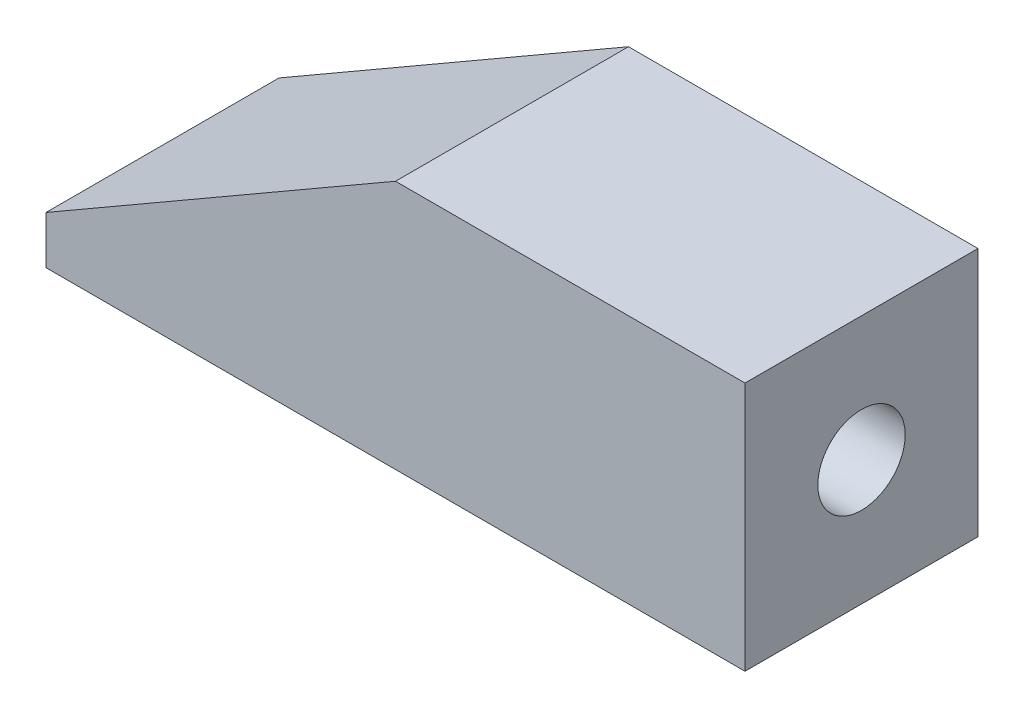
ISO-10303-21;
HEADER;
FILE_DESCRIPTION(('STEP AP214'),'2;1');
FILE_NAME('part.step','',(''),(''),'','','');
FILE_SCHEMA(('AUTOMOTIVE_DESIGN { 1 0 10303 214 1 1 1 1 }'));
ENDSEC;
DATA;
#1=APPLICATION_CONTEXT('core data for automotive mechanical design processes');
#2=APPLICATION_PROTOCOL_DEFINITION('international standard','automotive_design',2000,#1);
#3=PRODUCT_CONTEXT('',#1,'mechanical');
#4=PRODUCT('Part','Part','',(#3));
#5=PRODUCT_RELATED_PRODUCT_CATEGORY('part','',(#4));
#6=PRODUCT_DEFINITION_FORMATION('','',#4);
#7=PRODUCT_DEFINITION_CONTEXT('part definition',#1,'design');
#8=PRODUCT_DEFINITION('design','',#6,#7);
#9=PRODUCT_DEFINITION_SHAPE('','',#8);
#10=(LENGTH_UNIT() NAMED_UNIT(*) SI_UNIT(.MILLI.,.METRE.));
#11=(NAMED_UNIT(*) PLANE_ANGLE_UNIT() SI_UNIT($,.RADIAN.));
#12=(NAMED_UNIT(*) SI_UNIT($,.STERADIAN.) SOLID_ANGLE_UNIT());
#13=UNCERTAINTY_MEASURE_WITH_UNIT(LENGTH_MEASURE(1.E-05),#10,'distance_accuracy_value','');
#14=(GEOMETRIC_REPRESENTATION_CONTEXT(3) GLOBAL_UNCERTAINTY_ASSIGNED_CONTEXT((#13)) GLOBAL_UNIT_ASSIGNED_CONTEXT((#10,
#11,#12)) REPRESENTATION_CONTEXT('',''));
#15=CARTESIAN_POINT('',(0.,0.,0.));
#16=DIRECTION('',(0.,0.,1.));
#17=DIRECTION('',(1.,0.,0.));
#18=AXIS2_PLACEMENT_3D('',#15,#16,#17);
#19=CARTESIAN_POINT('',(0.,0.,28.));
#20=DIRECTION('',(1.,0.,0.));
#21=DIRECTION('',(0.,1.,0.));
#22=AXIS2_PLACEMENT_3D('',#19,#20,#21);
#23=PLANE('',#22);
#24=DIRECTION('',(0.,-1.,0.));
#25=VECTOR('',#24,1.);
#26=CARTESIAN_POINT('',(0.,0.,0.));
#27=LINE('',#26,#25);
#28=CARTESIAN_POINT('',(0.,5.75128869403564,0.));
#29=VERTEX_POINT('',#28);
#30=CARTESIAN_POINT('',(0.,0.,0.));
#31=VERTEX_POINT('',#30);
#32=EDGE_CURVE('E95',#29,#31,#27,.T.);
#33=ORIENTED_EDGE('',*,*,#32,.T.);
#34=DIRECTION('',(0.,0.,-1.));
#35=VECTOR('',#34,1.);
#36=CARTESIAN_POINT('',(0.,0.,28.));
#37=LINE('',#36,#35);
#38=CARTESIAN_POINT('',(0.,0.,28.));
#39=VERTEX_POINT('',#38);
#40=EDGE_CURVE('E11',#39,#31,#37,.T.);
#41=ORIENTED_EDGE('',*,*,#40,.F.);
#42=DIRECTION('',(0.,-1.,0.));
#43=VECTOR('',#42,1.);
#44=CARTESIAN_POINT('',(0.,0.,28.));
#45=LINE('',#44,#43);
#46=CARTESIAN_POINT('',(0.,5.75128869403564,28.));
#47=VERTEX_POINT('',#46);
#48=EDGE_CURVE('E108',#47,#39,#45,.T.);
#49=ORIENTED_EDGE('',*,*,#48,.F.);
#50=DIRECTION('',(0.,0.,-1.));
#51=VECTOR('',#50,1.);
#52=CARTESIAN_POINT('',(0.,5.75128869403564,28.));
#53=LINE('',#52,#51);
#54=EDGE_CURVE('E116',#47,#29,#53,.T.);
#55=ORIENTED_EDGE('',*,*,#54,.T.);
#56=EDGE_LOOP('',(#33,#41,#49,#55));
#57=FACE_BOUND('',#56,.T.);
#58=ADVANCED_FACE('F36',(#57),#23,.F.);
#59=CARTESIAN_POINT('',(0.,0.,28.));
#60=DIRECTION('',(0.,1.,0.));
#61=DIRECTION('',(0.,0.,1.));
#62=AXIS2_PLACEMENT_3D('',#59,#60,#61);
#63=PLANE('',#62);
#64=DIRECTION('',(1.,0.,0.));
#65=VECTOR('',#64,1.);
#66=CARTESIAN_POINT('',(0.,0.,0.));
#67=LINE('',#66,#65);
#68=CARTESIAN_POINT('',(84.,0.,0.));
#69=VERTEX_POINT('',#68);
#70=EDGE_CURVE('E100',#31,#69,#67,.T.);
#71=ORIENTED_EDGE('',*,*,#70,.T.);
#72=DIRECTION('',(0.,0.,-1.));
#73=VECTOR('',#72,1.);
#74=CARTESIAN_POINT('',(84.,0.,28.));
#75=LINE('',#74,#73);
#76=CARTESIAN_POINT('',(84.,0.,28.));
#77=VERTEX_POINT('',#76);
#78=EDGE_CURVE('E43',#77,#69,#75,.T.);
#79=ORIENTED_EDGE('',*,*,#78,.F.);
#80=DIRECTION('',(1.,0.,0.));
#81=VECTOR('',#80,1.);
#82=CARTESIAN_POINT('',(0.,0.,28.));
#83=LINE('',#82,#81);
#84=EDGE_CURVE('E110',#39,#77,#83,.T.);
#85=ORIENTED_EDGE('',*,*,#84,.F.);
#86=ORIENTED_EDGE('',*,*,#40,.T.);
#87=EDGE_LOOP('',(#71,#79,#85,#86));
#88=FACE_BOUND('',#87,.T.);
#89=ADVANCED_FACE('F145',(#88),#63,.F.);
#90=CARTESIAN_POINT('',(84.,0.,28.));
#91=DIRECTION('',(-1.,0.,0.));
#92=DIRECTION('',(0.,0.,1.));
#93=AXIS2_PLACEMENT_3D('',#90,#91,#92);
#94=PLANE('',#93);
#95=CARTESIAN_POINT('',(84.,15.,14.));
#96=DIRECTION('',(1.,0.,0.));
#97=DIRECTION('',(0.,0.,-1.));
#98=AXIS2_PLACEMENT_3D('',#95,#96,#97);
#99=CIRCLE('',#98,5.24999999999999);
#100=CARTESIAN_POINT('',(84.,15.,8.75));
#101=VERTEX_POINT('',#100);
#102=EDGE_CURVE('E92',#101,#101,#99,.T.);
#103=ORIENTED_EDGE('',*,*,#102,.F.);
#104=EDGE_LOOP('',(#103));
#105=FACE_BOUND('',#104,.T.);
#106=DIRECTION('',(0.,1.,0.));
#107=VECTOR('',#106,1.);
#108=CARTESIAN_POINT('',(84.,0.,0.));
#109=LINE('',#108,#107);
#110=CARTESIAN_POINT('',(84.,30.,0.));
#111=VERTEX_POINT('',#110);
#112=EDGE_CURVE('E102',#69,#111,#109,.T.);
#113=ORIENTED_EDGE('',*,*,#112,.T.);
#114=DIRECTION('',(0.,0.,-1.));
#115=VECTOR('',#114,1.);
#116=CARTESIAN_POINT('',(84.,30.,28.));
#117=LINE('',#116,#115);
#118=CARTESIAN_POINT('',(84.,30.,28.));
#119=VERTEX_POINT('',#118);
#120=EDGE_CURVE('E122',#119,#111,#117,.T.);
#121=ORIENTED_EDGE('',*,*,#120,.F.);
#122=DIRECTION('',(0.,1.,0.));
#123=VECTOR('',#122,1.);
#124=CARTESIAN_POINT('',(84.,0.,28.));
#125=LINE('',#124,#123);
#126=EDGE_CURVE('E112',#77,#119,#125,.T.);
#127=ORIENTED_EDGE('',*,*,#126,.F.);
#128=ORIENTED_EDGE('',*,*,#78,.T.);
#129=EDGE_LOOP('',(#113,#121,#127,#128));
#130=FACE_BOUND('',#129,.T.);
#131=ADVANCED_FACE('F129',(#105,#130),#94,.F.);
#132=CARTESIAN_POINT('',(42.,30.,28.));
#133=DIRECTION('',(0.,-1.,0.));
#134=DIRECTION('',(0.,0.,-1.));
#135=AXIS2_PLACEMENT_3D('',#132,#133,#134);
#136=PLANE('',#135);
#137=DIRECTION('',(-1.,0.,0.));
#138=VECTOR('',#137,1.);
#139=CARTESIAN_POINT('',(42.,30.,0.));
#140=LINE('',#139,#138);
#141=CARTESIAN_POINT('',(42.,30.,0.));
#142=VERTEX_POINT('',#141);
#143=EDGE_CURVE('E104',#111,#142,#140,.T.);
#144=ORIENTED_EDGE('',*,*,#143,.T.);
#145=DIRECTION('',(0.,0.,-1.));
#146=VECTOR('',#145,1.);
#147=CARTESIAN_POINT('',(42.,30.,28.));
#148=LINE('',#147,#146);
#149=CARTESIAN_POINT('',(42.,30.,28.));
#150=VERTEX_POINT('',#149);
#151=EDGE_CURVE('E119',#150,#142,#148,.T.);
#152=ORIENTED_EDGE('',*,*,#151,.F.);
#153=DIRECTION('',(-1.,0.,0.));
#154=VECTOR('',#153,1.);
#155=CARTESIAN_POINT('',(42.,30.,28.));
#156=LINE('',#155,#154);
#157=EDGE_CURVE('E55',#119,#150,#156,.T.);
#158=ORIENTED_EDGE('',*,*,#157,.F.);
#159=ORIENTED_EDGE('',*,*,#120,.T.);
#160=EDGE_LOOP('',(#144,#152,#158,#159));
#161=FACE_BOUND('',#160,.T.);
#162=ADVANCED_FACE('F138',(#161),#136,.F.);
#163=CARTESIAN_POINT('',(0.,5.75128869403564,28.));
#164=DIRECTION('',(0.500000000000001,-0.866025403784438,0.));
#165=DIRECTION('',(0.866025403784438,0.500000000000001,0.));
#166=AXIS2_PLACEMENT_3D('',#163,#164,#165);
#167=PLANE('',#166);
#168=DIRECTION('',(-0.866025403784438,-0.500000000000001,0.));
#169=VECTOR('',#168,1.);
#170=CARTESIAN_POINT('',(0.,5.75128869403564,0.));
#171=LINE('',#170,#169);
#172=EDGE_CURVE('E106',#142,#29,#171,.T.);
#173=ORIENTED_EDGE('',*,*,#172,.T.);
#174=ORIENTED_EDGE('',*,*,#54,.F.);
#175=DIRECTION('',(-0.866025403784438,-0.500000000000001,0.));
#176=VECTOR('',#175,1.);
#177=CARTESIAN_POINT('',(0.,5.75128869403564,28.));
#178=LINE('',#177,#176);
#179=EDGE_CURVE('E50',#150,#47,#178,.T.);
#180=ORIENTED_EDGE('',*,*,#179,.F.);
#181=ORIENTED_EDGE('',*,*,#151,.T.);
#182=EDGE_LOOP('',(#173,#174,#180,#181));
#183=FACE_BOUND('',#182,.T.);
#184=ADVANCED_FACE('F140',(#183),#167,.F.);
#185=CARTESIAN_POINT('',(0.,30.,28.));
#186=DIRECTION('',(0.,0.,-1.));
#187=DIRECTION('',(-1.,0.,0.));
#188=AXIS2_PLACEMENT_3D('',#185,#186,#187);
#189=PLANE('',#188);
#190=ORIENTED_EDGE('',*,*,#48,.T.);
#191=ORIENTED_EDGE('',*,*,#84,.T.);
#192=ORIENTED_EDGE('',*,*,#126,.T.);
#193=ORIENTED_EDGE('',*,*,#157,.T.);
#194=ORIENTED_EDGE('',*,*,#179,.T.);
#195=EDGE_LOOP('',(#190,#191,#192,#193,#194));
#196=FACE_BOUND('',#195,.T.);
#197=ADVANCED_FACE('F144',(#196),#189,.F.);
#198=CARTESIAN_POINT('',(0.,30.,0.));
#199=DIRECTION('',(0.,0.,-1.));
#200=DIRECTION('',(-1.,0.,0.));
#201=AXIS2_PLACEMENT_3D('',#198,#199,#200);
#202=PLANE('',#201);
#203=ORIENTED_EDGE('',*,*,#32,.F.);
#204=ORIENTED_EDGE('',*,*,#172,.F.);
#205=ORIENTED_EDGE('',*,*,#143,.F.);
#206=ORIENTED_EDGE('',*,*,#112,.F.);
#207=ORIENTED_EDGE('',*,*,#70,.F.);
#208=EDGE_LOOP('',(#203,#204,#205,#206,#207));
#209=FACE_BOUND('',#208,.T.);
#210=ADVANCED_FACE('F135',(#209),#202,.T.);
#211=CARTESIAN_POINT('',(84.,15.,14.));
#212=DIRECTION('',(1.,0.,0.));
#213=DIRECTION('',(0.,0.,-1.));
#214=AXIS2_PLACEMENT_3D('',#211,#212,#213);
#215=CYLINDRICAL_SURFACE('',#214,5.24999999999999);
#216=CARTESIAN_POINT('',(52.5,15.,14.));
#217=DIRECTION('',(1.,0.,0.));
#218=DIRECTION('',(0.,0.,-1.));
#219=AXIS2_PLACEMENT_3D('',#216,#217,#218);
#220=CIRCLE('',#219,5.24999999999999);
#221=CARTESIAN_POINT('',(52.5,15.,8.75000000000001));
#222=VERTEX_POINT('',#221);
#223=EDGE_CURVE('E90',#222,#222,#220,.T.);
#224=ORIENTED_EDGE('',*,*,#223,.F.);
#225=EDGE_LOOP('',(#224));
#226=FACE_BOUND('',#225,.T.);
#227=ORIENTED_EDGE('',*,*,#102,.T.);
#228=EDGE_LOOP('',(#227));
#229=FACE_BOUND('',#228,.T.);
#230=ADVANCED_FACE('F86',(#226,#229),#215,.F.);
#231=CARTESIAN_POINT('',(52.5,15.,14.));
#232=DIRECTION('',(1.,0.,0.));
#233=DIRECTION('',(0.,0.,-1.));
#234=AXIS2_PLACEMENT_3D('',#231,#232,#233);
#235=CONICAL_SURFACE('',#234,5.24999999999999,1.02974425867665);
#236=CARTESIAN_POINT('',(49.3454817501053,15.,14.));
#237=VERTEX_POINT('',#236);
#238=VERTEX_LOOP('',#237);
#239=FACE_BOUND('',#238,.T.);
#240=ORIENTED_EDGE('',*,*,#223,.T.);
#241=EDGE_LOOP('',(#240));
#242=FACE_BOUND('',#241,.T.);
#243=ADVANCED_FACE('F83',(#239,#242),#235,.F.);
#244=CLOSED_SHELL('',(#58,#89,#131,#162,#184,#197,#210,#230,#243));
#245=MANIFOLD_SOLID_BREP('B2',#244);
#246=ADVANCED_BREP_SHAPE_REPRESENTATION('',(#18,#245),#14);
#247=SHAPE_DEFINITION_REPRESENTATION(#9,#246);
ENDSEC;
END-ISO-10303-21;
